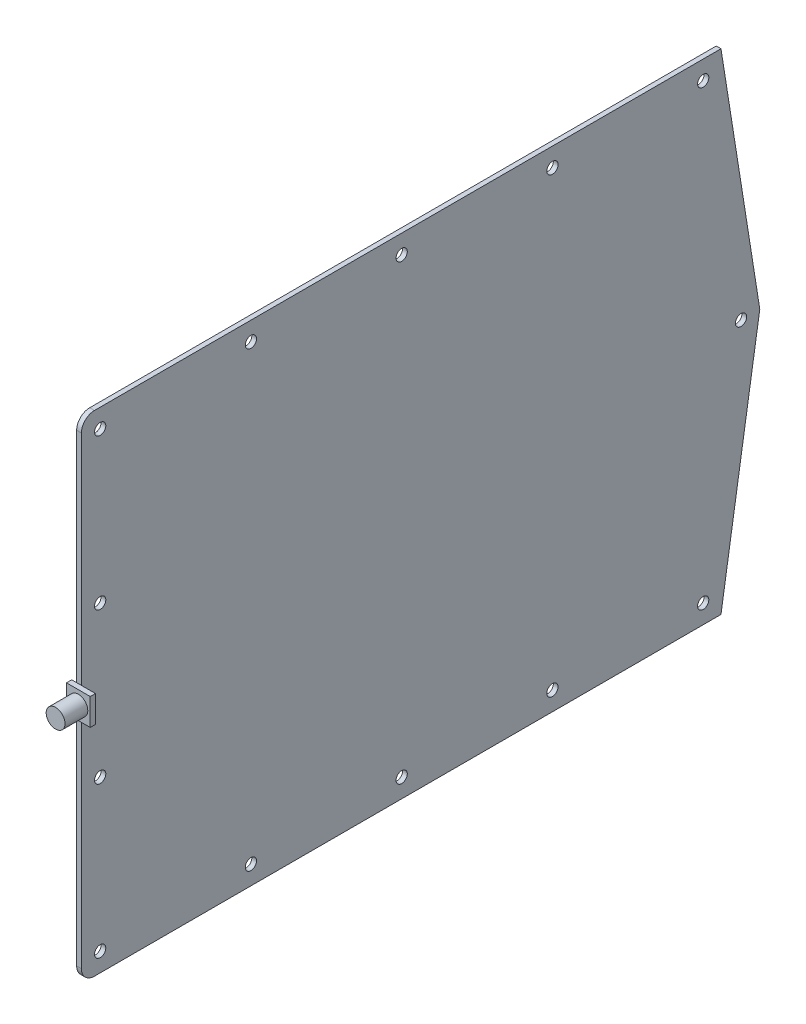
from build123d import *

# Parameters (mm, degrees)
BOSS_EXTRUDE1_DEPTH = 1.6002
FILLET1_R           = 4.3942
SKETCH3_R           = 1.8923
CUT_EXTRUDE1_DEPTH  = 189.067379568
SKETCH4_W           = 7.9883
SKETCH4_H           = 9.0297
BOSS_EXTRUDE2_DEPTH = 1.7526
SKETCH5_R           = 3.175
BOSS_EXTRUDE3_DEPTH = 7.6708


with BuildPart() as part:
    # Sketch1 → Boss-Extrude1 (new body)
    with BuildSketch(Plane(origin=(0, 0, 0), x_dir=(0, 0, -1), z_dir=(1, 0, 0))):
        Polygon((46.544812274, 82.55), (59.625812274, 0), (46.544812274, -82.55), (-168.974187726, -82.55), (-168.974187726, 82.55), align=None)
    extrude(amount=BOSS_EXTRUDE1_DEPTH)

    # Fillet1
    fillet1_edges = [part.edges().sort_by_distance(p)[0] for p in [
        (0.8001, -82.55, 168.974187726),
        (0.8001, 82.55, 168.974187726),
    ]]
    fillet(fillet1_edges, radius=FILLET1_R)

    # Sketch3 → Cut-Extrude1 (cut, through all)
    with BuildSketch(Plane(origin=(1.6002, 0, 0), x_dir=(0, 0, -1), z_dir=(1, 0, 0))):
        with Locations((40.550412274, -76.2)):
            Circle(SKETCH3_R)
        with Locations((-10.249587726, -76.2)):
            Circle(SKETCH3_R)
        with Locations((-61.049587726, -76.2)):
            Circle(SKETCH3_R)
        with Locations((-111.849587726, -76.2)):
            Circle(SKETCH3_R)
        with Locations((-162.649587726, -76.2)):
            Circle(SKETCH3_R)
        with Locations((-162.649587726, -25.4)):
            Circle(SKETCH3_R)
        with Locations((-162.649587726, 25.4)):
            Circle(SKETCH3_R)
        with Locations((-162.649587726, 76.2)):
            Circle(SKETCH3_R)
        with Locations((-111.849587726, 76.2)):
            Circle(SKETCH3_R)
        with Locations((-61.049587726, 76.2)):
            Circle(SKETCH3_R)
        with Locations((-10.249587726, 76.2)):
            Circle(SKETCH3_R)
        with Locations((40.550412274, 76.2)):
            Circle(SKETCH3_R)
        with Locations((53.301212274, 0)):
            Circle(SKETCH3_R)
    extrude(amount=-CUT_EXTRUDE1_DEPTH, mode=Mode.SUBTRACT)

    # Sketch4 → Boss-Extrude2 (add)
    with BuildSketch(Plane.XY.offset(168.974187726)):
        with Locations((2.33045, 0)):
            Rectangle(SKETCH4_W, SKETCH4_H)
    extrude(amount=BOSS_EXTRUDE2_DEPTH)

    # Sketch5 → Boss-Extrude3 (add)
    with BuildSketch(Plane.XY.offset(170.726787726)):
        with Locations((2.33045, 0)):
            Circle(SKETCH5_R)
    extrude(amount=BOSS_EXTRUDE3_DEPTH)


solid = part.part
